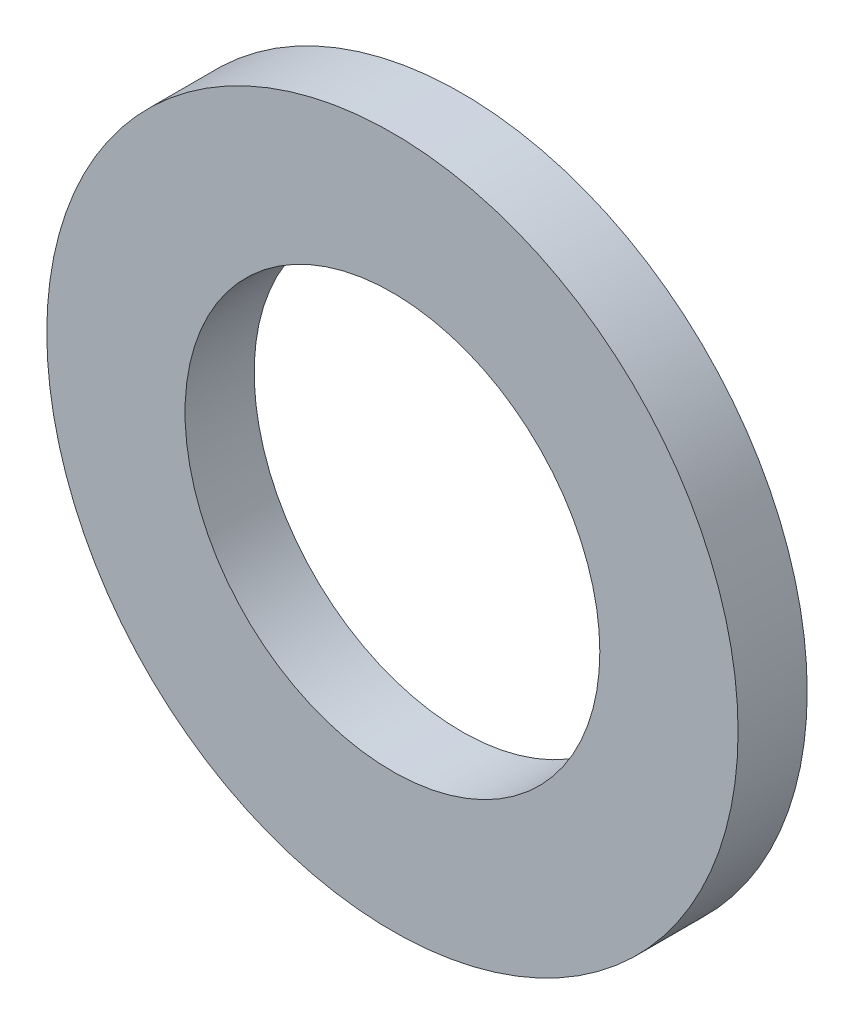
ISO-10303-21;
HEADER;
FILE_DESCRIPTION(('STEP AP214'),'2;1');
FILE_NAME('part.step','',(''),(''),'','','');
FILE_SCHEMA(('AUTOMOTIVE_DESIGN { 1 0 10303 214 1 1 1 1 }'));
ENDSEC;
DATA;
#1=APPLICATION_CONTEXT('core data for automotive mechanical design processes');
#2=APPLICATION_PROTOCOL_DEFINITION('international standard','automotive_design',2000,#1);
#3=PRODUCT_CONTEXT('',#1,'mechanical');
#4=PRODUCT('Part','Part','',(#3));
#5=PRODUCT_RELATED_PRODUCT_CATEGORY('part','',(#4));
#6=PRODUCT_DEFINITION_FORMATION('','',#4);
#7=PRODUCT_DEFINITION_CONTEXT('part definition',#1,'design');
#8=PRODUCT_DEFINITION('design','',#6,#7);
#9=PRODUCT_DEFINITION_SHAPE('','',#8);
#10=(LENGTH_UNIT() NAMED_UNIT(*) SI_UNIT(.MILLI.,.METRE.));
#11=(NAMED_UNIT(*) PLANE_ANGLE_UNIT() SI_UNIT($,.RADIAN.));
#12=(NAMED_UNIT(*) SI_UNIT($,.STERADIAN.) SOLID_ANGLE_UNIT());
#13=UNCERTAINTY_MEASURE_WITH_UNIT(LENGTH_MEASURE(1.E-05),#10,'distance_accuracy_value','');
#14=(GEOMETRIC_REPRESENTATION_CONTEXT(3) GLOBAL_UNCERTAINTY_ASSIGNED_CONTEXT((#13)) GLOBAL_UNIT_ASSIGNED_CONTEXT((#10,
#11,#12)) REPRESENTATION_CONTEXT('',''));
#15=CARTESIAN_POINT('',(0.,0.,0.));
#16=DIRECTION('',(0.,0.,1.));
#17=DIRECTION('',(1.,0.,0.));
#18=AXIS2_PLACEMENT_3D('',#15,#16,#17);
#19=CARTESIAN_POINT('',(0.,0.,3.));
#20=DIRECTION('',(0.,0.,1.));
#21=DIRECTION('',(1.,0.,0.));
#22=AXIS2_PLACEMENT_3D('',#19,#20,#21);
#23=PLANE('',#22);
#24=CARTESIAN_POINT('',(0.,0.,3.));
#25=DIRECTION('',(0.,0.,1.));
#26=DIRECTION('',(1.,0.,0.));
#27=AXIS2_PLACEMENT_3D('',#24,#25,#26);
#28=CIRCLE('',#27,9.);
#29=CARTESIAN_POINT('',(9.,0.,3.));
#30=VERTEX_POINT('',#29);
#31=EDGE_CURVE('E20',#30,#30,#28,.T.);
#32=ORIENTED_EDGE('',*,*,#31,.F.);
#33=EDGE_LOOP('',(#32));
#34=FACE_BOUND('',#33,.T.);
#35=CARTESIAN_POINT('',(0.,0.,3.));
#36=DIRECTION('',(0.,0.,1.));
#37=DIRECTION('',(1.,0.,0.));
#38=AXIS2_PLACEMENT_3D('',#35,#36,#37);
#39=CIRCLE('',#38,15.);
#40=CARTESIAN_POINT('',(15.,0.,3.));
#41=VERTEX_POINT('',#40);
#42=EDGE_CURVE('E59',#41,#41,#39,.T.);
#43=ORIENTED_EDGE('',*,*,#42,.T.);
#44=EDGE_LOOP('',(#43));
#45=FACE_BOUND('',#44,.T.);
#46=ADVANCED_FACE('F16',(#34,#45),#23,.T.);
#47=CARTESIAN_POINT('',(0.,0.,0.));
#48=DIRECTION('',(0.,0.,1.));
#49=DIRECTION('',(1.,0.,0.));
#50=AXIS2_PLACEMENT_3D('',#47,#48,#49);
#51=PLANE('',#50);
#52=CARTESIAN_POINT('',(0.,0.,0.));
#53=DIRECTION('',(0.,0.,1.));
#54=DIRECTION('',(1.,0.,0.));
#55=AXIS2_PLACEMENT_3D('',#52,#53,#54);
#56=CIRCLE('',#55,9.);
#57=CARTESIAN_POINT('',(9.,0.,0.));
#58=VERTEX_POINT('',#57);
#59=EDGE_CURVE('E10',#58,#58,#56,.T.);
#60=ORIENTED_EDGE('',*,*,#59,.T.);
#61=EDGE_LOOP('',(#60));
#62=FACE_BOUND('',#61,.T.);
#63=CARTESIAN_POINT('',(0.,0.,0.));
#64=DIRECTION('',(0.,0.,1.));
#65=DIRECTION('',(1.,0.,0.));
#66=AXIS2_PLACEMENT_3D('',#63,#64,#65);
#67=CIRCLE('',#66,15.);
#68=CARTESIAN_POINT('',(15.,0.,0.));
#69=VERTEX_POINT('',#68);
#70=EDGE_CURVE('E58',#69,#69,#67,.T.);
#71=ORIENTED_EDGE('',*,*,#70,.F.);
#72=EDGE_LOOP('',(#71));
#73=FACE_BOUND('',#72,.T.);
#74=ADVANCED_FACE('F18',(#62,#73),#51,.F.);
#75=CARTESIAN_POINT('',(0.,0.,0.));
#76=DIRECTION('',(0.,0.,-1.));
#77=DIRECTION('',(1.,0.,0.));
#78=AXIS2_PLACEMENT_3D('',#75,#76,#77);
#79=CYLINDRICAL_SURFACE('',#78,9.);
#80=DIRECTION('',(0.,0.,1.));
#81=VECTOR('',#80,1.);
#82=CARTESIAN_POINT('',(9.,0.,0.));
#83=LINE('',#82,#81);
#84=EDGE_CURVE('E65',#58,#30,#83,.T.);
#85=ORIENTED_EDGE('',*,*,#84,.T.);
#86=ORIENTED_EDGE('',*,*,#31,.T.);
#87=ORIENTED_EDGE('',*,*,#84,.F.);
#88=ORIENTED_EDGE('',*,*,#59,.F.);
#89=EDGE_LOOP('',(#85,#86,#87,#88));
#90=FACE_BOUND('',#89,.T.);
#91=ADVANCED_FACE('F79',(#90),#79,.F.);
#92=CARTESIAN_POINT('',(0.,0.,0.));
#93=DIRECTION('',(0.,0.,-1.));
#94=DIRECTION('',(1.,0.,0.));
#95=AXIS2_PLACEMENT_3D('',#92,#93,#94);
#96=CYLINDRICAL_SURFACE('',#95,15.);
#97=ORIENTED_EDGE('',*,*,#70,.T.);
#98=DIRECTION('',(0.,0.,1.));
#99=VECTOR('',#98,1.);
#100=CARTESIAN_POINT('',(15.,0.,0.));
#101=LINE('',#100,#99);
#102=EDGE_CURVE('E55',#69,#41,#101,.T.);
#103=ORIENTED_EDGE('',*,*,#102,.T.);
#104=ORIENTED_EDGE('',*,*,#42,.F.);
#105=ORIENTED_EDGE('',*,*,#102,.F.);
#106=EDGE_LOOP('',(#97,#103,#104,#105));
#107=FACE_BOUND('',#106,.T.);
#108=ADVANCED_FACE('F56',(#107),#96,.T.);
#109=CLOSED_SHELL('',(#46,#74,#91,#108));
#110=MANIFOLD_SOLID_BREP('B1',#109);
#111=ADVANCED_BREP_SHAPE_REPRESENTATION('',(#18,#110),#14);
#112=SHAPE_DEFINITION_REPRESENTATION(#9,#111);
ENDSEC;
END-ISO-10303-21;
